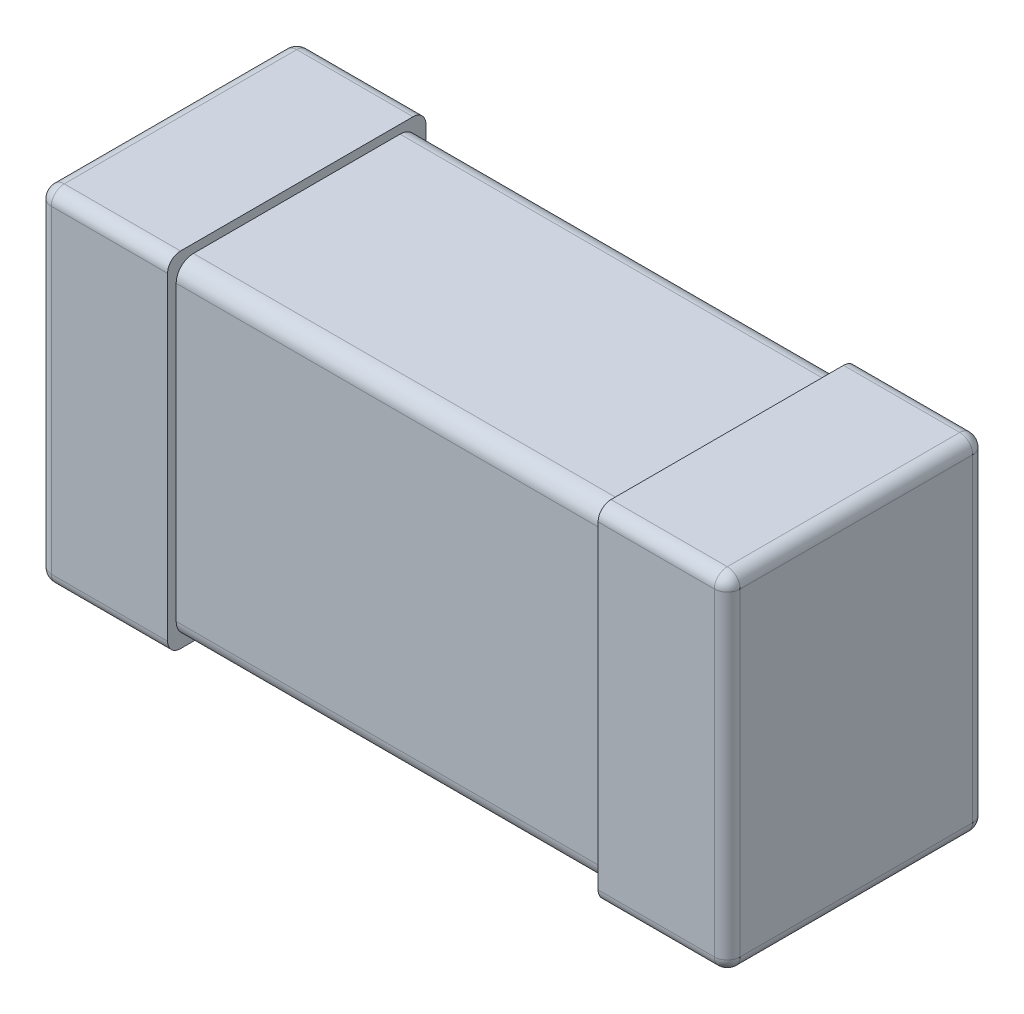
ISO-10303-21;
HEADER;
FILE_DESCRIPTION(('STEP AP214'),'2;1');
FILE_NAME('part.step','',(''),(''),'','','');
FILE_SCHEMA(('AUTOMOTIVE_DESIGN { 1 0 10303 214 1 1 1 1 }'));
ENDSEC;
DATA;
#1=APPLICATION_CONTEXT('core data for automotive mechanical design processes');
#2=APPLICATION_PROTOCOL_DEFINITION('international standard','automotive_design',2000,#1);
#3=PRODUCT_CONTEXT('',#1,'mechanical');
#4=PRODUCT('Part','Part','',(#3));
#5=PRODUCT_RELATED_PRODUCT_CATEGORY('part','',(#4));
#6=PRODUCT_DEFINITION_FORMATION('','',#4);
#7=PRODUCT_DEFINITION_CONTEXT('part definition',#1,'design');
#8=PRODUCT_DEFINITION('design','',#6,#7);
#9=PRODUCT_DEFINITION_SHAPE('','',#8);
#10=(LENGTH_UNIT() NAMED_UNIT(*) SI_UNIT(.MILLI.,.METRE.));
#11=(NAMED_UNIT(*) PLANE_ANGLE_UNIT() SI_UNIT($,.RADIAN.));
#12=(NAMED_UNIT(*) SI_UNIT($,.STERADIAN.) SOLID_ANGLE_UNIT());
#13=UNCERTAINTY_MEASURE_WITH_UNIT(LENGTH_MEASURE(1.E-05),#10,'distance_accuracy_value','');
#14=(GEOMETRIC_REPRESENTATION_CONTEXT(3) GLOBAL_UNCERTAINTY_ASSIGNED_CONTEXT((#13)) GLOBAL_UNIT_ASSIGNED_CONTEXT((#10,
#11,#12)) REPRESENTATION_CONTEXT('',''));
#15=CARTESIAN_POINT('',(0.,0.,0.));
#16=DIRECTION('',(0.,0.,1.));
#17=DIRECTION('',(1.,0.,0.));
#18=AXIS2_PLACEMENT_3D('',#15,#16,#17);
#19=CARTESIAN_POINT('',(0.8,0.4,0.6));
#20=DIRECTION('',(-1.,0.,0.));
#21=DIRECTION('',(0.,0.,1.));
#22=AXIS2_PLACEMENT_3D('',#19,#20,#21);
#23=PLANE('',#22);
#24=DIRECTION('',(0.,0.,-1.));
#25=VECTOR('',#24,1.);
#26=CARTESIAN_POINT('',(0.8,-0.37,0.6));
#27=LINE('',#26,#25);
#28=CARTESIAN_POINT('',(0.8,-0.37,0.03));
#29=VERTEX_POINT('',#28);
#30=CARTESIAN_POINT('',(0.8,-0.37,0.57));
#31=VERTEX_POINT('',#30);
#32=EDGE_CURVE('E514',#29,#31,#27,.F.);
#33=ORIENTED_EDGE('',*,*,#32,.F.);
#34=DIRECTION('',(0.,-1.,0.));
#35=VECTOR('',#34,1.);
#36=CARTESIAN_POINT('',(0.8,0.4,0.03));
#37=LINE('',#36,#35);
#38=CARTESIAN_POINT('',(0.8,0.37,0.03));
#39=VERTEX_POINT('',#38);
#40=EDGE_CURVE('E513',#39,#29,#37,.T.);
#41=ORIENTED_EDGE('',*,*,#40,.F.);
#42=DIRECTION('',(0.,0.,-1.));
#43=VECTOR('',#42,1.);
#44=CARTESIAN_POINT('',(0.8,0.37,0.6));
#45=LINE('',#44,#43);
#46=CARTESIAN_POINT('',(0.8,0.37,0.57));
#47=VERTEX_POINT('',#46);
#48=EDGE_CURVE('E480',#47,#39,#45,.T.);
#49=ORIENTED_EDGE('',*,*,#48,.F.);
#50=DIRECTION('',(0.,1.,0.));
#51=VECTOR('',#50,1.);
#52=CARTESIAN_POINT('',(0.8,-0.4,0.57));
#53=LINE('',#52,#51);
#54=EDGE_CURVE('E583',#31,#47,#53,.T.);
#55=ORIENTED_EDGE('',*,*,#54,.F.);
#56=EDGE_LOOP('',(#33,#41,#49,#55));
#57=FACE_BOUND('',#56,.T.);
#58=ADVANCED_FACE('F17',(#57),#23,.F.);
#59=CARTESIAN_POINT('',(-0.8,0.4,0.6));
#60=DIRECTION('',(1.,0.,0.));
#61=DIRECTION('',(0.,0.,-1.));
#62=AXIS2_PLACEMENT_3D('',#59,#60,#61);
#63=PLANE('',#62);
#64=DIRECTION('',(0.,0.,-1.));
#65=VECTOR('',#64,1.);
#66=CARTESIAN_POINT('',(-0.8,0.37,0.6));
#67=LINE('',#66,#65);
#68=CARTESIAN_POINT('',(-0.8,0.37,0.03));
#69=VERTEX_POINT('',#68);
#70=CARTESIAN_POINT('',(-0.8,0.37,0.57));
#71=VERTEX_POINT('',#70);
#72=EDGE_CURVE('E555',#69,#71,#67,.F.);
#73=ORIENTED_EDGE('',*,*,#72,.F.);
#74=DIRECTION('',(0.,-1.,0.));
#75=VECTOR('',#74,1.);
#76=CARTESIAN_POINT('',(-0.8,0.4,0.03));
#77=LINE('',#76,#75);
#78=CARTESIAN_POINT('',(-0.8,-0.37,0.03));
#79=VERTEX_POINT('',#78);
#80=EDGE_CURVE('E370',#79,#69,#77,.F.);
#81=ORIENTED_EDGE('',*,*,#80,.F.);
#82=DIRECTION('',(0.,0.,-1.));
#83=VECTOR('',#82,1.);
#84=CARTESIAN_POINT('',(-0.8,-0.37,0.6));
#85=LINE('',#84,#83);
#86=CARTESIAN_POINT('',(-0.8,-0.37,0.57));
#87=VERTEX_POINT('',#86);
#88=EDGE_CURVE('E564',#87,#79,#85,.T.);
#89=ORIENTED_EDGE('',*,*,#88,.F.);
#90=DIRECTION('',(0.,1.,0.));
#91=VECTOR('',#90,1.);
#92=CARTESIAN_POINT('',(-0.8,-0.4,0.57));
#93=LINE('',#92,#91);
#94=EDGE_CURVE('E420',#71,#87,#93,.F.);
#95=ORIENTED_EDGE('',*,*,#94,.F.);
#96=EDGE_LOOP('',(#73,#81,#89,#95));
#97=FACE_BOUND('',#96,.T.);
#98=ADVANCED_FACE('F544',(#97),#63,.F.);
#99=CARTESIAN_POINT('',(0.77,0.37,0.57));
#100=DIRECTION('',(1.,0.,0.));
#101=DIRECTION('',(0.,0.,-1.));
#102=AXIS2_PLACEMENT_3D('',#99,#100,#101);
#103=SPHERICAL_SURFACE('',#102,0.03);
#104=CARTESIAN_POINT('',(0.77,0.37,0.57));
#105=DIRECTION('',(-1.,0.,0.));
#106=DIRECTION('',(0.,-1.,0.));
#107=AXIS2_PLACEMENT_3D('',#104,#105,#106);
#108=CIRCLE('',#107,0.03);
#109=CARTESIAN_POINT('',(0.77,0.37,0.6));
#110=VERTEX_POINT('',#109);
#111=CARTESIAN_POINT('',(0.77,0.4,0.57));
#112=VERTEX_POINT('',#111);
#113=EDGE_CURVE('E361',#110,#112,#108,.T.);
#114=ORIENTED_EDGE('',*,*,#113,.F.);
#115=CARTESIAN_POINT('',(0.77,0.37,0.57));
#116=DIRECTION('',(0.,1.,0.));
#117=DIRECTION('',(0.,0.,1.));
#118=AXIS2_PLACEMENT_3D('',#115,#116,#117);
#119=CIRCLE('',#118,0.03);
#120=EDGE_CURVE('E586',#47,#110,#119,.F.);
#121=ORIENTED_EDGE('',*,*,#120,.F.);
#122=CARTESIAN_POINT('',(0.77,0.37,0.57));
#123=DIRECTION('',(0.,0.,-1.));
#124=DIRECTION('',(-1.,0.,0.));
#125=AXIS2_PLACEMENT_3D('',#122,#123,#124);
#126=CIRCLE('',#125,0.03);
#127=EDGE_CURVE('E466',#112,#47,#126,.T.);
#128=ORIENTED_EDGE('',*,*,#127,.F.);
#129=EDGE_LOOP('',(#114,#121,#128));
#130=FACE_BOUND('',#129,.T.);
#131=ADVANCED_FACE('F540',(#130),#103,.T.);
#132=CARTESIAN_POINT('',(0.77,-0.4,0.57));
#133=DIRECTION('',(0.,1.,0.));
#134=DIRECTION('',(0.,0.,1.));
#135=AXIS2_PLACEMENT_3D('',#132,#133,#134);
#136=CYLINDRICAL_SURFACE('',#135,0.03);
#137=CARTESIAN_POINT('',(0.77,-0.37,0.57));
#138=DIRECTION('',(0.,-1.,0.));
#139=DIRECTION('',(1.,0.,0.));
#140=AXIS2_PLACEMENT_3D('',#137,#138,#139);
#141=CIRCLE('',#140,0.03);
#142=CARTESIAN_POINT('',(0.77,-0.37,0.6));
#143=VERTEX_POINT('',#142);
#144=EDGE_CURVE('E520',#31,#143,#141,.T.);
#145=ORIENTED_EDGE('',*,*,#144,.F.);
#146=ORIENTED_EDGE('',*,*,#54,.T.);
#147=ORIENTED_EDGE('',*,*,#120,.T.);
#148=DIRECTION('',(0.,1.,0.));
#149=VECTOR('',#148,1.);
#150=CARTESIAN_POINT('',(0.77,-0.4,0.6));
#151=LINE('',#150,#149);
#152=EDGE_CURVE('E360',#110,#143,#151,.F.);
#153=ORIENTED_EDGE('',*,*,#152,.T.);
#154=EDGE_LOOP('',(#145,#146,#147,#153));
#155=FACE_BOUND('',#154,.T.);
#156=ADVANCED_FACE('F536',(#155),#136,.T.);
#157=CARTESIAN_POINT('',(0.77,-0.37,0.57));
#158=DIRECTION('',(1.,0.,0.));
#159=DIRECTION('',(0.,0.,-1.));
#160=AXIS2_PLACEMENT_3D('',#157,#158,#159);
#161=SPHERICAL_SURFACE('',#160,0.03);
#162=CARTESIAN_POINT('',(0.77,-0.37,0.57));
#163=DIRECTION('',(1.,0.,0.));
#164=DIRECTION('',(0.,1.,0.));
#165=AXIS2_PLACEMENT_3D('',#162,#163,#164);
#166=CIRCLE('',#165,0.03);
#167=CARTESIAN_POINT('',(0.77,-0.4,0.57));
#168=VERTEX_POINT('',#167);
#169=EDGE_CURVE('E354',#168,#143,#166,.F.);
#170=ORIENTED_EDGE('',*,*,#169,.F.);
#171=CARTESIAN_POINT('',(0.77,-0.37,0.57));
#172=DIRECTION('',(0.,0.,-1.));
#173=DIRECTION('',(-1.,0.,0.));
#174=AXIS2_PLACEMENT_3D('',#171,#172,#173);
#175=CIRCLE('',#174,0.03);
#176=EDGE_CURVE('E517',#31,#168,#175,.T.);
#177=ORIENTED_EDGE('',*,*,#176,.F.);
#178=ORIENTED_EDGE('',*,*,#144,.T.);
#179=EDGE_LOOP('',(#170,#177,#178));
#180=FACE_BOUND('',#179,.T.);
#181=ADVANCED_FACE('F533',(#180),#161,.T.);
#182=CARTESIAN_POINT('',(0.77,-0.37,0.6));
#183=DIRECTION('',(0.,0.,-1.));
#184=DIRECTION('',(-1.,0.,0.));
#185=AXIS2_PLACEMENT_3D('',#182,#183,#184);
#186=CYLINDRICAL_SURFACE('',#185,0.03);
#187=CARTESIAN_POINT('',(0.77,-0.37,0.03));
#188=DIRECTION('',(0.,-2.6663722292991E-13,-1.));
#189=DIRECTION('',(1.,0.,0.));
#190=AXIS2_PLACEMENT_3D('',#187,#188,#189);
#191=CIRCLE('',#190,0.03);
#192=CARTESIAN_POINT('',(0.77,-0.4,0.030000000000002));
#193=VERTEX_POINT('',#192);
#194=EDGE_CURVE('E510',#29,#193,#191,.T.);
#195=ORIENTED_EDGE('',*,*,#194,.F.);
#196=ORIENTED_EDGE('',*,*,#32,.T.);
#197=ORIENTED_EDGE('',*,*,#176,.T.);
#198=DIRECTION('',(0.,0.,1.));
#199=VECTOR('',#198,1.);
#200=CARTESIAN_POINT('',(0.77,-0.4,0.6));
#201=LINE('',#200,#199);
#202=EDGE_CURVE('E348',#168,#193,#201,.F.);
#203=ORIENTED_EDGE('',*,*,#202,.T.);
#204=EDGE_LOOP('',(#195,#196,#197,#203));
#205=FACE_BOUND('',#204,.T.);
#206=ADVANCED_FACE('F502',(#205),#186,.T.);
#207=CARTESIAN_POINT('',(0.77,-0.37,0.03));
#208=DIRECTION('',(1.,0.,0.));
#209=DIRECTION('',(0.,0.,-1.));
#210=AXIS2_PLACEMENT_3D('',#207,#208,#209);
#211=SPHERICAL_SURFACE('',#210,0.03);
#212=CARTESIAN_POINT('',(0.77,-0.37,0.03));
#213=DIRECTION('',(0.,-1.,0.));
#214=DIRECTION('',(0.,0.,-1.));
#215=AXIS2_PLACEMENT_3D('',#212,#213,#214);
#216=CIRCLE('',#215,0.03);
#217=CARTESIAN_POINT('',(0.77,-0.37,0.));
#218=VERTEX_POINT('',#217);
#219=EDGE_CURVE('E576',#29,#218,#216,.F.);
#220=ORIENTED_EDGE('',*,*,#219,.F.);
#221=ORIENTED_EDGE('',*,*,#194,.T.);
#222=CARTESIAN_POINT('',(0.77,-0.37,0.03));
#223=DIRECTION('',(-1.,0.,0.));
#224=DIRECTION('',(0.,-1.,0.));
#225=AXIS2_PLACEMENT_3D('',#222,#223,#224);
#226=CIRCLE('',#225,0.03);
#227=EDGE_CURVE('E342',#218,#193,#226,.T.);
#228=ORIENTED_EDGE('',*,*,#227,.F.);
#229=EDGE_LOOP('',(#220,#221,#228));
#230=FACE_BOUND('',#229,.T.);
#231=ADVANCED_FACE('F497',(#230),#211,.T.);
#232=CARTESIAN_POINT('',(0.77,0.4,0.03));
#233=DIRECTION('',(0.,-1.,0.));
#234=DIRECTION('',(0.,0.,-1.));
#235=AXIS2_PLACEMENT_3D('',#232,#233,#234);
#236=CYLINDRICAL_SURFACE('',#235,0.03);
#237=ORIENTED_EDGE('',*,*,#219,.T.);
#238=DIRECTION('',(0.,1.,0.));
#239=VECTOR('',#238,1.);
#240=CARTESIAN_POINT('',(0.77,-0.4,0.));
#241=LINE('',#240,#239);
#242=CARTESIAN_POINT('',(0.77,0.37,0.));
#243=VERTEX_POINT('',#242);
#244=EDGE_CURVE('E336',#243,#218,#241,.F.);
#245=ORIENTED_EDGE('',*,*,#244,.F.);
#246=CARTESIAN_POINT('',(0.77,0.37,0.03));
#247=DIRECTION('',(0.,1.,0.));
#248=DIRECTION('',(1.,0.,0.));
#249=AXIS2_PLACEMENT_3D('',#246,#247,#248);
#250=CIRCLE('',#249,0.03);
#251=EDGE_CURVE('E467',#39,#243,#250,.T.);
#252=ORIENTED_EDGE('',*,*,#251,.F.);
#253=ORIENTED_EDGE('',*,*,#40,.T.);
#254=EDGE_LOOP('',(#237,#245,#252,#253));
#255=FACE_BOUND('',#254,.T.);
#256=ADVANCED_FACE('F493',(#255),#236,.T.);
#257=CARTESIAN_POINT('',(0.77,0.37,0.03));
#258=DIRECTION('',(1.,0.,0.));
#259=DIRECTION('',(0.,0.,-1.));
#260=AXIS2_PLACEMENT_3D('',#257,#258,#259);
#261=SPHERICAL_SURFACE('',#260,0.03);
#262=CARTESIAN_POINT('',(0.77,0.37,0.03));
#263=DIRECTION('',(0.,0.,-1.));
#264=DIRECTION('',(-1.,0.,0.));
#265=AXIS2_PLACEMENT_3D('',#262,#263,#264);
#266=CIRCLE('',#265,0.03);
#267=CARTESIAN_POINT('',(0.77,0.4,0.03));
#268=VERTEX_POINT('',#267);
#269=EDGE_CURVE('E463',#39,#268,#266,.F.);
#270=ORIENTED_EDGE('',*,*,#269,.F.);
#271=ORIENTED_EDGE('',*,*,#251,.T.);
#272=CARTESIAN_POINT('',(0.77,0.37,0.03));
#273=DIRECTION('',(1.,0.,0.));
#274=DIRECTION('',(0.,1.,0.));
#275=AXIS2_PLACEMENT_3D('',#272,#273,#274);
#276=CIRCLE('',#275,0.03);
#277=EDGE_CURVE('E330',#268,#243,#276,.F.);
#278=ORIENTED_EDGE('',*,*,#277,.F.);
#279=EDGE_LOOP('',(#270,#271,#278));
#280=FACE_BOUND('',#279,.T.);
#281=ADVANCED_FACE('F490',(#280),#261,.T.);
#282=CARTESIAN_POINT('',(0.77,0.37,0.6));
#283=DIRECTION('',(0.,0.,-1.));
#284=DIRECTION('',(-1.,0.,0.));
#285=AXIS2_PLACEMENT_3D('',#282,#283,#284);
#286=CYLINDRICAL_SURFACE('',#285,0.03);
#287=ORIENTED_EDGE('',*,*,#127,.T.);
#288=ORIENTED_EDGE('',*,*,#48,.T.);
#289=ORIENTED_EDGE('',*,*,#269,.T.);
#290=DIRECTION('',(0.,0.,1.));
#291=VECTOR('',#290,1.);
#292=CARTESIAN_POINT('',(0.77,0.4,0.6));
#293=LINE('',#292,#291);
#294=EDGE_CURVE('E316',#268,#112,#293,.T.);
#295=ORIENTED_EDGE('',*,*,#294,.T.);
#296=EDGE_LOOP('',(#287,#288,#289,#295));
#297=FACE_BOUND('',#296,.T.);
#298=ADVANCED_FACE('F451',(#297),#286,.T.);
#299=CARTESIAN_POINT('',(-0.77,-0.37,0.03));
#300=DIRECTION('',(1.,0.,0.));
#301=DIRECTION('',(0.,0.,-1.));
#302=AXIS2_PLACEMENT_3D('',#299,#300,#301);
#303=SPHERICAL_SURFACE('',#302,0.03);
#304=CARTESIAN_POINT('',(-0.77,-0.37,0.03));
#305=DIRECTION('',(0.,0.,-1.));
#306=DIRECTION('',(-1.,0.,0.));
#307=AXIS2_PLACEMENT_3D('',#304,#305,#306);
#308=CIRCLE('',#307,0.03);
#309=CARTESIAN_POINT('',(-0.77,-0.4,0.03));
#310=VERTEX_POINT('',#309);
#311=EDGE_CURVE('E567',#79,#310,#308,.F.);
#312=ORIENTED_EDGE('',*,*,#311,.F.);
#313=CARTESIAN_POINT('',(-0.77,-0.37,0.03));
#314=DIRECTION('',(0.,-1.,0.));
#315=DIRECTION('',(0.,0.,-1.));
#316=AXIS2_PLACEMENT_3D('',#313,#314,#315);
#317=CIRCLE('',#316,0.03);
#318=CARTESIAN_POINT('',(-0.77,-0.37,0.));
#319=VERTEX_POINT('',#318);
#320=EDGE_CURVE('E381',#319,#79,#317,.F.);
#321=ORIENTED_EDGE('',*,*,#320,.F.);
#322=CARTESIAN_POINT('',(-0.77,-0.37,0.03));
#323=DIRECTION('',(1.,0.,0.));
#324=DIRECTION('',(0.,0.,-1.));
#325=AXIS2_PLACEMENT_3D('',#322,#323,#324);
#326=CIRCLE('',#325,0.03);
#327=EDGE_CURVE('E303',#310,#319,#326,.T.);
#328=ORIENTED_EDGE('',*,*,#327,.F.);
#329=EDGE_LOOP('',(#312,#321,#328));
#330=FACE_BOUND('',#329,.T.);
#331=ADVANCED_FACE('F446',(#330),#303,.T.);
#332=CARTESIAN_POINT('',(-0.77,-0.37,0.6));
#333=DIRECTION('',(0.,0.,-1.));
#334=DIRECTION('',(-1.,0.,0.));
#335=AXIS2_PLACEMENT_3D('',#332,#333,#334);
#336=CYLINDRICAL_SURFACE('',#335,0.03);
#337=CARTESIAN_POINT('',(-0.77,-0.37,0.57));
#338=DIRECTION('',(0.,-8.51781474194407E-12,-1.));
#339=DIRECTION('',(1.,0.,0.));
#340=AXIS2_PLACEMENT_3D('',#337,#338,#339);
#341=CIRCLE('',#340,0.03);
#342=CARTESIAN_POINT('',(-0.77,-0.4,0.570000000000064));
#343=VERTEX_POINT('',#342);
#344=EDGE_CURVE('E430',#87,#343,#341,.F.);
#345=ORIENTED_EDGE('',*,*,#344,.F.);
#346=ORIENTED_EDGE('',*,*,#88,.T.);
#347=ORIENTED_EDGE('',*,*,#311,.T.);
#348=DIRECTION('',(0.,0.,1.));
#349=VECTOR('',#348,1.);
#350=CARTESIAN_POINT('',(-0.77,-0.4,0.6));
#351=LINE('',#350,#349);
#352=EDGE_CURVE('E302',#310,#343,#351,.T.);
#353=ORIENTED_EDGE('',*,*,#352,.T.);
#354=EDGE_LOOP('',(#345,#346,#347,#353));
#355=FACE_BOUND('',#354,.T.);
#356=ADVANCED_FACE('F442',(#355),#336,.T.);
#357=CARTESIAN_POINT('',(-0.77,-0.37,0.57));
#358=DIRECTION('',(1.,0.,0.));
#359=DIRECTION('',(0.,0.,-1.));
#360=AXIS2_PLACEMENT_3D('',#357,#358,#359);
#361=SPHERICAL_SURFACE('',#360,0.03);
#362=CARTESIAN_POINT('',(-0.77,-0.37,0.57));
#363=DIRECTION('',(-1.,0.,0.));
#364=DIRECTION('',(0.,0.,1.));
#365=AXIS2_PLACEMENT_3D('',#362,#363,#364);
#366=CIRCLE('',#365,0.03);
#367=CARTESIAN_POINT('',(-0.77,-0.37,0.6));
#368=VERTEX_POINT('',#367);
#369=EDGE_CURVE('E296',#368,#343,#366,.F.);
#370=ORIENTED_EDGE('',*,*,#369,.F.);
#371=CARTESIAN_POINT('',(-0.77,-0.37,0.57));
#372=DIRECTION('',(0.,1.,0.));
#373=DIRECTION('',(0.,0.,1.));
#374=AXIS2_PLACEMENT_3D('',#371,#372,#373);
#375=CIRCLE('',#374,0.03);
#376=EDGE_CURVE('E427',#87,#368,#375,.T.);
#377=ORIENTED_EDGE('',*,*,#376,.F.);
#378=ORIENTED_EDGE('',*,*,#344,.T.);
#379=EDGE_LOOP('',(#370,#377,#378));
#380=FACE_BOUND('',#379,.T.);
#381=ADVANCED_FACE('F439',(#380),#361,.T.);
#382=CARTESIAN_POINT('',(-0.77,-0.4,0.57));
#383=DIRECTION('',(0.,1.,0.));
#384=DIRECTION('',(0.,0.,1.));
#385=AXIS2_PLACEMENT_3D('',#382,#383,#384);
#386=CYLINDRICAL_SURFACE('',#385,0.03);
#387=CARTESIAN_POINT('',(-0.77,0.37,0.57));
#388=DIRECTION('',(0.,-1.,0.));
#389=DIRECTION('',(1.,0.,0.));
#390=AXIS2_PLACEMENT_3D('',#387,#388,#389);
#391=CIRCLE('',#390,0.03);
#392=CARTESIAN_POINT('',(-0.77,0.37,0.6));
#393=VERTEX_POINT('',#392);
#394=EDGE_CURVE('E416',#71,#393,#391,.F.);
#395=ORIENTED_EDGE('',*,*,#394,.F.);
#396=ORIENTED_EDGE('',*,*,#94,.T.);
#397=ORIENTED_EDGE('',*,*,#376,.T.);
#398=DIRECTION('',(0.,1.,0.));
#399=VECTOR('',#398,1.);
#400=CARTESIAN_POINT('',(-0.77,-0.4,0.6));
#401=LINE('',#400,#399);
#402=EDGE_CURVE('E290',#393,#368,#401,.F.);
#403=ORIENTED_EDGE('',*,*,#402,.F.);
#404=EDGE_LOOP('',(#395,#396,#397,#403));
#405=FACE_BOUND('',#404,.T.);
#406=ADVANCED_FACE('F408',(#405),#386,.T.);
#407=CARTESIAN_POINT('',(-0.77,0.37,0.57));
#408=DIRECTION('',(1.,0.,0.));
#409=DIRECTION('',(0.,0.,-1.));
#410=AXIS2_PLACEMENT_3D('',#407,#408,#409);
#411=SPHERICAL_SURFACE('',#410,0.03);
#412=CARTESIAN_POINT('',(-0.77,0.37,0.57));
#413=DIRECTION('',(1.,0.,0.));
#414=DIRECTION('',(0.,0.,-1.));
#415=AXIS2_PLACEMENT_3D('',#412,#413,#414);
#416=CIRCLE('',#415,0.03);
#417=CARTESIAN_POINT('',(-0.77,0.4,0.57));
#418=VERTEX_POINT('',#417);
#419=EDGE_CURVE('E284',#418,#393,#416,.T.);
#420=ORIENTED_EDGE('',*,*,#419,.F.);
#421=CARTESIAN_POINT('',(-0.77,0.37,0.57));
#422=DIRECTION('',(0.,0.,-1.));
#423=DIRECTION('',(-1.,0.,0.));
#424=AXIS2_PLACEMENT_3D('',#421,#422,#423);
#425=CIRCLE('',#424,0.03);
#426=EDGE_CURVE('E419',#71,#418,#425,.T.);
#427=ORIENTED_EDGE('',*,*,#426,.F.);
#428=ORIENTED_EDGE('',*,*,#394,.T.);
#429=EDGE_LOOP('',(#420,#427,#428));
#430=FACE_BOUND('',#429,.T.);
#431=ADVANCED_FACE('F403',(#430),#411,.T.);
#432=CARTESIAN_POINT('',(-0.77,0.37,0.6));
#433=DIRECTION('',(0.,0.,-1.));
#434=DIRECTION('',(-1.,0.,0.));
#435=AXIS2_PLACEMENT_3D('',#432,#433,#434);
#436=CYLINDRICAL_SURFACE('',#435,0.03);
#437=CARTESIAN_POINT('',(-0.77,0.37,0.03));
#438=DIRECTION('',(0.,0.,1.));
#439=DIRECTION('',(1.,0.,0.));
#440=AXIS2_PLACEMENT_3D('',#437,#438,#439);
#441=CIRCLE('',#440,0.03);
#442=CARTESIAN_POINT('',(-0.77,0.4,0.03));
#443=VERTEX_POINT('',#442);
#444=EDGE_CURVE('E384',#69,#443,#441,.F.);
#445=ORIENTED_EDGE('',*,*,#444,.F.);
#446=ORIENTED_EDGE('',*,*,#72,.T.);
#447=ORIENTED_EDGE('',*,*,#426,.T.);
#448=DIRECTION('',(0.,0.,-1.));
#449=VECTOR('',#448,1.);
#450=CARTESIAN_POINT('',(-0.77,0.4,0.6));
#451=LINE('',#450,#449);
#452=EDGE_CURVE('E278',#418,#443,#451,.T.);
#453=ORIENTED_EDGE('',*,*,#452,.T.);
#454=EDGE_LOOP('',(#445,#446,#447,#453));
#455=FACE_BOUND('',#454,.T.);
#456=ADVANCED_FACE('F399',(#455),#436,.T.);
#457=CARTESIAN_POINT('',(-0.77,0.37,0.03));
#458=DIRECTION('',(1.,0.,0.));
#459=DIRECTION('',(0.,0.,-1.));
#460=AXIS2_PLACEMENT_3D('',#457,#458,#459);
#461=SPHERICAL_SURFACE('',#460,0.03);
#462=CARTESIAN_POINT('',(-0.77,0.37,0.03));
#463=DIRECTION('',(0.,-1.,0.));
#464=DIRECTION('',(0.,0.,-1.));
#465=AXIS2_PLACEMENT_3D('',#462,#463,#464);
#466=CIRCLE('',#465,0.03);
#467=CARTESIAN_POINT('',(-0.77,0.37,0.));
#468=VERTEX_POINT('',#467);
#469=EDGE_CURVE('E367',#69,#468,#466,.T.);
#470=ORIENTED_EDGE('',*,*,#469,.F.);
#471=ORIENTED_EDGE('',*,*,#444,.T.);
#472=CARTESIAN_POINT('',(-0.77,0.37,0.03));
#473=DIRECTION('',(-1.,0.,0.));
#474=DIRECTION('',(0.,0.,1.));
#475=AXIS2_PLACEMENT_3D('',#472,#473,#474);
#476=CIRCLE('',#475,0.03);
#477=EDGE_CURVE('E136',#468,#443,#476,.F.);
#478=ORIENTED_EDGE('',*,*,#477,.F.);
#479=EDGE_LOOP('',(#470,#471,#478));
#480=FACE_BOUND('',#479,.T.);
#481=ADVANCED_FACE('F394',(#480),#461,.T.);
#482=CARTESIAN_POINT('',(-0.77,0.4,0.03));
#483=DIRECTION('',(0.,-1.,0.));
#484=DIRECTION('',(0.,0.,-1.));
#485=AXIS2_PLACEMENT_3D('',#482,#483,#484);
#486=CYLINDRICAL_SURFACE('',#485,0.03);
#487=ORIENTED_EDGE('',*,*,#469,.T.);
#488=DIRECTION('',(0.,1.,0.));
#489=VECTOR('',#488,1.);
#490=CARTESIAN_POINT('',(-0.77,-0.4,0.));
#491=LINE('',#490,#489);
#492=EDGE_CURVE('E263',#468,#319,#491,.F.);
#493=ORIENTED_EDGE('',*,*,#492,.T.);
#494=ORIENTED_EDGE('',*,*,#320,.T.);
#495=ORIENTED_EDGE('',*,*,#80,.T.);
#496=EDGE_LOOP('',(#487,#493,#494,#495));
#497=FACE_BOUND('',#496,.T.);
#498=ADVANCED_FACE('F398',(#497),#486,.T.);
#499=CARTESIAN_POINT('',(0.5,0.37,0.57));
#500=DIRECTION('',(-1.,0.,0.));
#501=DIRECTION('',(0.,-1.,0.));
#502=AXIS2_PLACEMENT_3D('',#499,#500,#501);
#503=CYLINDRICAL_SURFACE('',#502,0.03);
#504=ORIENTED_EDGE('',*,*,#113,.T.);
#505=DIRECTION('',(1.,0.,0.));
#506=VECTOR('',#505,1.);
#507=CARTESIAN_POINT('',(0.8,0.4,0.57));
#508=LINE('',#507,#506);
#509=CARTESIAN_POINT('',(0.5,0.4,0.57));
#510=VERTEX_POINT('',#509);
#511=EDGE_CURVE('E321',#112,#510,#508,.F.);
#512=ORIENTED_EDGE('',*,*,#511,.T.);
#513=CARTESIAN_POINT('',(0.5,0.37,0.57));
#514=DIRECTION('',(-1.,0.,0.));
#515=DIRECTION('',(0.,-1.,0.));
#516=AXIS2_PLACEMENT_3D('',#513,#514,#515);
#517=CIRCLE('',#516,0.03);
#518=CARTESIAN_POINT('',(0.5,0.37,0.6));
#519=VERTEX_POINT('',#518);
#520=EDGE_CURVE('E251',#510,#519,#517,.F.);
#521=ORIENTED_EDGE('',*,*,#520,.T.);
#522=DIRECTION('',(-1.,0.,0.));
#523=VECTOR('',#522,1.);
#524=CARTESIAN_POINT('',(0.5,0.37,0.6));
#525=LINE('',#524,#523);
#526=EDGE_CURVE('E357',#519,#110,#525,.F.);
#527=ORIENTED_EDGE('',*,*,#526,.T.);
#528=EDGE_LOOP('',(#504,#512,#521,#527));
#529=FACE_BOUND('',#528,.T.);
#530=ADVANCED_FACE('F938',(#529),#503,.T.);
#531=CARTESIAN_POINT('',(0.5,-0.4,0.6));
#532=DIRECTION('',(0.,0.,-1.));
#533=DIRECTION('',(-1.,0.,0.));
#534=AXIS2_PLACEMENT_3D('',#531,#532,#533);
#535=PLANE('',#534);
#536=ORIENTED_EDGE('',*,*,#526,.F.);
#537=DIRECTION('',(0.,1.,0.));
#538=VECTOR('',#537,1.);
#539=CARTESIAN_POINT('',(0.5,0.4,0.6));
#540=LINE('',#539,#538);
#541=CARTESIAN_POINT('',(0.5,-0.37,0.6));
#542=VERTEX_POINT('',#541);
#543=EDGE_CURVE('E249',#519,#542,#540,.F.);
#544=ORIENTED_EDGE('',*,*,#543,.T.);
#545=DIRECTION('',(1.,0.,0.));
#546=VECTOR('',#545,1.);
#547=CARTESIAN_POINT('',(0.5,-0.37,0.6));
#548=LINE('',#547,#546);
#549=EDGE_CURVE('E349',#143,#542,#548,.F.);
#550=ORIENTED_EDGE('',*,*,#549,.F.);
#551=ORIENTED_EDGE('',*,*,#152,.F.);
#552=EDGE_LOOP('',(#536,#544,#550,#551));
#553=FACE_BOUND('',#552,.T.);
#554=ADVANCED_FACE('F928',(#553),#535,.F.);
#555=CARTESIAN_POINT('',(0.5,-0.37,0.57));
#556=DIRECTION('',(1.,0.,0.));
#557=DIRECTION('',(0.,1.,0.));
#558=AXIS2_PLACEMENT_3D('',#555,#556,#557);
#559=CYLINDRICAL_SURFACE('',#558,0.03);
#560=ORIENTED_EDGE('',*,*,#169,.T.);
#561=ORIENTED_EDGE('',*,*,#549,.T.);
#562=CARTESIAN_POINT('',(0.5,-0.37,0.57));
#563=DIRECTION('',(1.,0.,0.));
#564=DIRECTION('',(0.,1.,0.));
#565=AXIS2_PLACEMENT_3D('',#562,#563,#564);
#566=CIRCLE('',#565,0.03);
#567=CARTESIAN_POINT('',(0.5,-0.4,0.57));
#568=VERTEX_POINT('',#567);
#569=EDGE_CURVE('E248',#542,#568,#566,.T.);
#570=ORIENTED_EDGE('',*,*,#569,.T.);
#571=DIRECTION('',(-1.,0.,0.));
#572=VECTOR('',#571,1.);
#573=CARTESIAN_POINT('',(0.8,-0.4,0.57));
#574=LINE('',#573,#572);
#575=EDGE_CURVE('E345',#568,#168,#574,.F.);
#576=ORIENTED_EDGE('',*,*,#575,.T.);
#577=EDGE_LOOP('',(#560,#561,#570,#576));
#578=FACE_BOUND('',#577,.T.);
#579=ADVANCED_FACE('F918',(#578),#559,.T.);
#580=CARTESIAN_POINT('',(0.8,-0.4,0.6));
#581=DIRECTION('',(0.,1.,0.));
#582=DIRECTION('',(-1.,0.,0.));
#583=AXIS2_PLACEMENT_3D('',#580,#581,#582);
#584=PLANE('',#583);
#585=DIRECTION('',(-1.,0.,0.));
#586=VECTOR('',#585,1.);
#587=CARTESIAN_POINT('',(0.8,-0.4,0.03));
#588=LINE('',#587,#586);
#589=CARTESIAN_POINT('',(0.5,-0.4,0.03));
#590=VERTEX_POINT('',#589);
#591=EDGE_CURVE('E339',#193,#590,#588,.T.);
#592=ORIENTED_EDGE('',*,*,#591,.F.);
#593=ORIENTED_EDGE('',*,*,#202,.F.);
#594=ORIENTED_EDGE('',*,*,#575,.F.);
#595=DIRECTION('',(0.,0.,1.));
#596=VECTOR('',#595,1.);
#597=CARTESIAN_POINT('',(0.5,-0.4,0.6));
#598=LINE('',#597,#596);
#599=EDGE_CURVE('E246',#568,#590,#598,.F.);
#600=ORIENTED_EDGE('',*,*,#599,.T.);
#601=EDGE_LOOP('',(#592,#593,#594,#600));
#602=FACE_BOUND('',#601,.T.);
#603=ADVANCED_FACE('F908',(#602),#584,.F.);
#604=CARTESIAN_POINT('',(0.8,-0.37,0.03));
#605=DIRECTION('',(-1.,0.,0.));
#606=DIRECTION('',(0.,-1.,0.));
#607=AXIS2_PLACEMENT_3D('',#604,#605,#606);
#608=CYLINDRICAL_SURFACE('',#607,0.03);
#609=ORIENTED_EDGE('',*,*,#227,.T.);
#610=ORIENTED_EDGE('',*,*,#591,.T.);
#611=CARTESIAN_POINT('',(0.5,-0.37,0.03));
#612=DIRECTION('',(-1.,0.,0.));
#613=DIRECTION('',(0.,-1.,0.));
#614=AXIS2_PLACEMENT_3D('',#611,#612,#613);
#615=CIRCLE('',#614,0.03);
#616=CARTESIAN_POINT('',(0.5,-0.37,0.));
#617=VERTEX_POINT('',#616);
#618=EDGE_CURVE('E245',#590,#617,#615,.F.);
#619=ORIENTED_EDGE('',*,*,#618,.T.);
#620=DIRECTION('',(-1.,0.,0.));
#621=VECTOR('',#620,1.);
#622=CARTESIAN_POINT('',(0.5,-0.37,0.));
#623=LINE('',#622,#621);
#624=EDGE_CURVE('E333',#218,#617,#623,.T.);
#625=ORIENTED_EDGE('',*,*,#624,.F.);
#626=EDGE_LOOP('',(#609,#610,#619,#625));
#627=FACE_BOUND('',#626,.T.);
#628=ADVANCED_FACE('F898',(#627),#608,.T.);
#629=CARTESIAN_POINT('',(0.5,-0.4,0.));
#630=DIRECTION('',(0.,0.,-1.));
#631=DIRECTION('',(-1.,0.,0.));
#632=AXIS2_PLACEMENT_3D('',#629,#630,#631);
#633=PLANE('',#632);
#634=ORIENTED_EDGE('',*,*,#244,.T.);
#635=ORIENTED_EDGE('',*,*,#624,.T.);
#636=DIRECTION('',(0.,1.,0.));
#637=VECTOR('',#636,1.);
#638=CARTESIAN_POINT('',(0.5,0.4,0.));
#639=LINE('',#638,#637);
#640=CARTESIAN_POINT('',(0.5,0.37,0.));
#641=VERTEX_POINT('',#640);
#642=EDGE_CURVE('E243',#617,#641,#639,.T.);
#643=ORIENTED_EDGE('',*,*,#642,.T.);
#644=DIRECTION('',(1.,0.,0.));
#645=VECTOR('',#644,1.);
#646=CARTESIAN_POINT('',(0.8,0.37,0.));
#647=LINE('',#646,#645);
#648=EDGE_CURVE('E325',#243,#641,#647,.F.);
#649=ORIENTED_EDGE('',*,*,#648,.F.);
#650=EDGE_LOOP('',(#634,#635,#643,#649));
#651=FACE_BOUND('',#650,.T.);
#652=ADVANCED_FACE('F888',(#651),#633,.T.);
#653=CARTESIAN_POINT('',(0.8,0.37,0.03));
#654=DIRECTION('',(1.,0.,0.));
#655=DIRECTION('',(0.,1.,0.));
#656=AXIS2_PLACEMENT_3D('',#653,#654,#655);
#657=CYLINDRICAL_SURFACE('',#656,0.03);
#658=ORIENTED_EDGE('',*,*,#277,.T.);
#659=ORIENTED_EDGE('',*,*,#648,.T.);
#660=CARTESIAN_POINT('',(0.5,0.37,0.03));
#661=DIRECTION('',(1.,0.,0.));
#662=DIRECTION('',(0.,1.,0.));
#663=AXIS2_PLACEMENT_3D('',#660,#661,#662);
#664=CIRCLE('',#663,0.03);
#665=CARTESIAN_POINT('',(0.5,0.4,0.03));
#666=VERTEX_POINT('',#665);
#667=EDGE_CURVE('E242',#641,#666,#664,.T.);
#668=ORIENTED_EDGE('',*,*,#667,.T.);
#669=DIRECTION('',(1.,0.,0.));
#670=VECTOR('',#669,1.);
#671=CARTESIAN_POINT('',(0.8,0.4,0.03));
#672=LINE('',#671,#670);
#673=EDGE_CURVE('E318',#666,#268,#672,.T.);
#674=ORIENTED_EDGE('',*,*,#673,.T.);
#675=EDGE_LOOP('',(#658,#659,#668,#674));
#676=FACE_BOUND('',#675,.T.);
#677=ADVANCED_FACE('F878',(#676),#657,.T.);
#678=CARTESIAN_POINT('',(0.8,0.4,0.6));
#679=DIRECTION('',(0.,-1.,0.));
#680=DIRECTION('',(1.,0.,0.));
#681=AXIS2_PLACEMENT_3D('',#678,#679,#680);
#682=PLANE('',#681);
#683=ORIENTED_EDGE('',*,*,#673,.F.);
#684=DIRECTION('',(0.,0.,1.));
#685=VECTOR('',#684,1.);
#686=CARTESIAN_POINT('',(0.5,0.4,0.6));
#687=LINE('',#686,#685);
#688=EDGE_CURVE('E239',#666,#510,#687,.T.);
#689=ORIENTED_EDGE('',*,*,#688,.T.);
#690=ORIENTED_EDGE('',*,*,#511,.F.);
#691=ORIENTED_EDGE('',*,*,#294,.F.);
#692=EDGE_LOOP('',(#683,#689,#690,#691));
#693=FACE_BOUND('',#692,.T.);
#694=ADVANCED_FACE('F869',(#693),#682,.F.);
#695=CARTESIAN_POINT('',(-0.5,-0.34,0.06));
#696=DIRECTION('',(1.,0.,0.));
#697=DIRECTION('',(0.,0.,-1.));
#698=AXIS2_PLACEMENT_3D('',#695,#696,#697);
#699=CYLINDRICAL_SURFACE('',#698,0.04);
#700=CARTESIAN_POINT('',(0.5,-0.34,0.06));
#701=DIRECTION('',(1.,0.,0.));
#702=DIRECTION('',(0.,0.,-1.));
#703=AXIS2_PLACEMENT_3D('',#700,#701,#702);
#704=CIRCLE('',#703,0.04);
#705=CARTESIAN_POINT('',(0.5,-0.34,0.02));
#706=VERTEX_POINT('',#705);
#707=CARTESIAN_POINT('',(0.5,-0.38,0.06));
#708=VERTEX_POINT('',#707);
#709=EDGE_CURVE('E253',#706,#708,#704,.F.);
#710=ORIENTED_EDGE('',*,*,#709,.T.);
#711=DIRECTION('',(1.,0.,0.));
#712=VECTOR('',#711,1.);
#713=CARTESIAN_POINT('',(-0.5,-0.38,0.06));
#714=LINE('',#713,#712);
#715=CARTESIAN_POINT('',(-0.5,-0.38,0.06));
#716=VERTEX_POINT('',#715);
#717=EDGE_CURVE('E259',#708,#716,#714,.F.);
#718=ORIENTED_EDGE('',*,*,#717,.T.);
#719=CARTESIAN_POINT('',(-0.5,-0.34,0.06));
#720=DIRECTION('',(1.,0.,0.));
#721=DIRECTION('',(0.,0.,-1.));
#722=AXIS2_PLACEMENT_3D('',#719,#720,#721);
#723=CIRCLE('',#722,0.04);
#724=CARTESIAN_POINT('',(-0.5,-0.34,0.02));
#725=VERTEX_POINT('',#724);
#726=EDGE_CURVE('E608',#716,#725,#723,.T.);
#727=ORIENTED_EDGE('',*,*,#726,.T.);
#728=DIRECTION('',(1.,0.,0.));
#729=VECTOR('',#728,1.);
#730=CARTESIAN_POINT('',(0.5,-0.34,0.02));
#731=LINE('',#730,#729);
#732=EDGE_CURVE('E314',#725,#706,#731,.T.);
#733=ORIENTED_EDGE('',*,*,#732,.T.);
#734=EDGE_LOOP('',(#710,#718,#727,#733));
#735=FACE_BOUND('',#734,.T.);
#736=ADVANCED_FACE('F616',(#735),#699,.T.);
#737=CARTESIAN_POINT('',(0.5,-0.38,0.02));
#738=DIRECTION('',(0.,0.,1.));
#739=DIRECTION('',(1.,0.,0.));
#740=AXIS2_PLACEMENT_3D('',#737,#738,#739);
#741=PLANE('',#740);
#742=DIRECTION('',(-1.,0.,0.));
#743=VECTOR('',#742,1.);
#744=CARTESIAN_POINT('',(-0.5,0.34,0.02));
#745=LINE('',#744,#743);
#746=CARTESIAN_POINT('',(0.5,0.34,0.02));
#747=VERTEX_POINT('',#746);
#748=CARTESIAN_POINT('',(-0.5,0.34,0.02));
#749=VERTEX_POINT('',#748);
#750=EDGE_CURVE('E311',#747,#749,#745,.T.);
#751=ORIENTED_EDGE('',*,*,#750,.F.);
#752=DIRECTION('',(0.,1.,0.));
#753=VECTOR('',#752,1.);
#754=CARTESIAN_POINT('',(0.5,0.4,0.0200000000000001));
#755=LINE('',#754,#753);
#756=EDGE_CURVE('E254',#747,#706,#755,.F.);
#757=ORIENTED_EDGE('',*,*,#756,.T.);
#758=ORIENTED_EDGE('',*,*,#732,.F.);
#759=DIRECTION('',(0.,1.,0.));
#760=VECTOR('',#759,1.);
#761=CARTESIAN_POINT('',(-0.5,0.4,0.0200000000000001));
#762=LINE('',#761,#760);
#763=EDGE_CURVE('E607',#725,#749,#762,.T.);
#764=ORIENTED_EDGE('',*,*,#763,.T.);
#765=EDGE_LOOP('',(#751,#757,#758,#764));
#766=FACE_BOUND('',#765,.T.);
#767=ADVANCED_FACE('F626',(#766),#741,.F.);
#768=CARTESIAN_POINT('',(-0.5,0.34,0.06));
#769=DIRECTION('',(-1.,0.,0.));
#770=DIRECTION('',(0.,0.,1.));
#771=AXIS2_PLACEMENT_3D('',#768,#769,#770);
#772=CYLINDRICAL_SURFACE('',#771,0.04);
#773=CARTESIAN_POINT('',(-0.5,0.34,0.06));
#774=DIRECTION('',(-1.,0.,0.));
#775=DIRECTION('',(0.,0.,1.));
#776=AXIS2_PLACEMENT_3D('',#773,#774,#775);
#777=CIRCLE('',#776,0.04);
#778=CARTESIAN_POINT('',(-0.5,0.38,0.06));
#779=VERTEX_POINT('',#778);
#780=EDGE_CURVE('E605',#749,#779,#777,.F.);
#781=ORIENTED_EDGE('',*,*,#780,.T.);
#782=DIRECTION('',(1.,0.,0.));
#783=VECTOR('',#782,1.);
#784=CARTESIAN_POINT('',(-0.5,0.38,0.06));
#785=LINE('',#784,#783);
#786=CARTESIAN_POINT('',(0.5,0.38,0.06));
#787=VERTEX_POINT('',#786);
#788=EDGE_CURVE('E126',#779,#787,#785,.T.);
#789=ORIENTED_EDGE('',*,*,#788,.T.);
#790=CARTESIAN_POINT('',(0.5,0.34,0.06));
#791=DIRECTION('',(-1.,0.,0.));
#792=DIRECTION('',(0.,0.,1.));
#793=AXIS2_PLACEMENT_3D('',#790,#791,#792);
#794=CIRCLE('',#793,0.04);
#795=EDGE_CURVE('E20',#787,#747,#794,.T.);
#796=ORIENTED_EDGE('',*,*,#795,.T.);
#797=ORIENTED_EDGE('',*,*,#750,.T.);
#798=EDGE_LOOP('',(#781,#789,#796,#797));
#799=FACE_BOUND('',#798,.T.);
#800=ADVANCED_FACE('F629',(#799),#772,.T.);
#801=CARTESIAN_POINT('',(-0.5,0.38,0.58));
#802=DIRECTION('',(0.,-1.,0.));
#803=DIRECTION('',(0.,0.,-1.));
#804=AXIS2_PLACEMENT_3D('',#801,#802,#803);
#805=PLANE('',#804);
#806=ORIENTED_EDGE('',*,*,#788,.F.);
#807=DIRECTION('',(0.,0.,1.));
#808=VECTOR('',#807,1.);
#809=CARTESIAN_POINT('',(-0.5,0.38,0.6));
#810=LINE('',#809,#808);
#811=CARTESIAN_POINT('',(-0.5,0.38,0.54));
#812=VERTEX_POINT('',#811);
#813=EDGE_CURVE('E604',#779,#812,#810,.T.);
#814=ORIENTED_EDGE('',*,*,#813,.T.);
#815=DIRECTION('',(1.,0.,0.));
#816=VECTOR('',#815,1.);
#817=CARTESIAN_POINT('',(0.5,0.38,0.54));
#818=LINE('',#817,#816);
#819=CARTESIAN_POINT('',(0.5,0.38,0.54));
#820=VERTEX_POINT('',#819);
#821=EDGE_CURVE('E306',#820,#812,#818,.F.);
#822=ORIENTED_EDGE('',*,*,#821,.F.);
#823=DIRECTION('',(0.,0.,1.));
#824=VECTOR('',#823,1.);
#825=CARTESIAN_POINT('',(0.5,0.38,0.6));
#826=LINE('',#825,#824);
#827=EDGE_CURVE('E257',#820,#787,#826,.F.);
#828=ORIENTED_EDGE('',*,*,#827,.T.);
#829=EDGE_LOOP('',(#806,#814,#822,#828));
#830=FACE_BOUND('',#829,.T.);
#831=ADVANCED_FACE('F836',(#830),#805,.F.);
#832=CARTESIAN_POINT('',(-0.8,-0.37,0.03));
#833=DIRECTION('',(1.,0.,0.));
#834=DIRECTION('',(0.,0.,-1.));
#835=AXIS2_PLACEMENT_3D('',#832,#833,#834);
#836=CYLINDRICAL_SURFACE('',#835,0.03);
#837=ORIENTED_EDGE('',*,*,#327,.T.);
#838=DIRECTION('',(1.,0.,0.));
#839=VECTOR('',#838,1.);
#840=CARTESIAN_POINT('',(-0.5,-0.37,0.));
#841=LINE('',#840,#839);
#842=CARTESIAN_POINT('',(-0.5,-0.37,0.));
#843=VERTEX_POINT('',#842);
#844=EDGE_CURVE('E264',#319,#843,#841,.T.);
#845=ORIENTED_EDGE('',*,*,#844,.T.);
#846=CARTESIAN_POINT('',(-0.5,-0.37,0.03));
#847=DIRECTION('',(1.,0.,0.));
#848=DIRECTION('',(0.,0.,-1.));
#849=AXIS2_PLACEMENT_3D('',#846,#847,#848);
#850=CIRCLE('',#849,0.03);
#851=CARTESIAN_POINT('',(-0.5,-0.4,0.03));
#852=VERTEX_POINT('',#851);
#853=EDGE_CURVE('E600',#843,#852,#850,.F.);
#854=ORIENTED_EDGE('',*,*,#853,.T.);
#855=DIRECTION('',(1.,0.,0.));
#856=VECTOR('',#855,1.);
#857=CARTESIAN_POINT('',(-0.8,-0.4,0.03));
#858=LINE('',#857,#856);
#859=EDGE_CURVE('E299',#852,#310,#858,.F.);
#860=ORIENTED_EDGE('',*,*,#859,.T.);
#861=EDGE_LOOP('',(#837,#845,#854,#860));
#862=FACE_BOUND('',#861,.T.);
#863=ADVANCED_FACE('F652',(#862),#836,.T.);
#864=CARTESIAN_POINT('',(-0.8,-0.4,0.6));
#865=DIRECTION('',(0.,1.,0.));
#866=DIRECTION('',(0.,0.,1.));
#867=AXIS2_PLACEMENT_3D('',#864,#865,#866);
#868=PLANE('',#867);
#869=ORIENTED_EDGE('',*,*,#859,.F.);
#870=DIRECTION('',(0.,0.,1.));
#871=VECTOR('',#870,1.);
#872=CARTESIAN_POINT('',(-0.5,-0.4,0.6));
#873=LINE('',#872,#871);
#874=CARTESIAN_POINT('',(-0.5,-0.4,0.57));
#875=VERTEX_POINT('',#874);
#876=EDGE_CURVE('E599',#852,#875,#873,.T.);
#877=ORIENTED_EDGE('',*,*,#876,.T.);
#878=DIRECTION('',(-1.,0.,0.));
#879=VECTOR('',#878,1.);
#880=CARTESIAN_POINT('',(-0.5,-0.4,0.57));
#881=LINE('',#880,#879);
#882=EDGE_CURVE('E293',#343,#875,#881,.F.);
#883=ORIENTED_EDGE('',*,*,#882,.F.);
#884=ORIENTED_EDGE('',*,*,#352,.F.);
#885=EDGE_LOOP('',(#869,#877,#883,#884));
#886=FACE_BOUND('',#885,.T.);
#887=ADVANCED_FACE('F656',(#886),#868,.F.);
#888=CARTESIAN_POINT('',(-0.5,-0.37,0.57));
#889=DIRECTION('',(-1.,0.,0.));
#890=DIRECTION('',(0.,0.,1.));
#891=AXIS2_PLACEMENT_3D('',#888,#889,#890);
#892=CYLINDRICAL_SURFACE('',#891,0.03);
#893=ORIENTED_EDGE('',*,*,#369,.T.);
#894=ORIENTED_EDGE('',*,*,#882,.T.);
#895=CARTESIAN_POINT('',(-0.5,-0.37,0.57));
#896=DIRECTION('',(-1.,0.,0.));
#897=DIRECTION('',(0.,0.,1.));
#898=AXIS2_PLACEMENT_3D('',#895,#896,#897);
#899=CIRCLE('',#898,0.03);
#900=CARTESIAN_POINT('',(-0.5,-0.37,0.6));
#901=VERTEX_POINT('',#900);
#902=EDGE_CURVE('E597',#875,#901,#899,.T.);
#903=ORIENTED_EDGE('',*,*,#902,.T.);
#904=DIRECTION('',(1.,0.,0.));
#905=VECTOR('',#904,1.);
#906=CARTESIAN_POINT('',(-0.5,-0.37,0.6));
#907=LINE('',#906,#905);
#908=EDGE_CURVE('E287',#368,#901,#907,.T.);
#909=ORIENTED_EDGE('',*,*,#908,.F.);
#910=EDGE_LOOP('',(#893,#894,#903,#909));
#911=FACE_BOUND('',#910,.T.);
#912=ADVANCED_FACE('F689',(#911),#892,.T.);
#913=CARTESIAN_POINT('',(-0.5,-0.4,0.6));
#914=DIRECTION('',(0.,0.,1.));
#915=DIRECTION('',(1.,0.,0.));
#916=AXIS2_PLACEMENT_3D('',#913,#914,#915);
#917=PLANE('',#916);
#918=ORIENTED_EDGE('',*,*,#402,.T.);
#919=ORIENTED_EDGE('',*,*,#908,.T.);
#920=DIRECTION('',(0.,1.,0.));
#921=VECTOR('',#920,1.);
#922=CARTESIAN_POINT('',(-0.5,0.4,0.6));
#923=LINE('',#922,#921);
#924=CARTESIAN_POINT('',(-0.5,0.37,0.6));
#925=VERTEX_POINT('',#924);
#926=EDGE_CURVE('E596',#901,#925,#923,.T.);
#927=ORIENTED_EDGE('',*,*,#926,.T.);
#928=DIRECTION('',(1.,0.,0.));
#929=VECTOR('',#928,1.);
#930=CARTESIAN_POINT('',(-0.5,0.37,0.6));
#931=LINE('',#930,#929);
#932=EDGE_CURVE('E279',#393,#925,#931,.T.);
#933=ORIENTED_EDGE('',*,*,#932,.F.);
#934=EDGE_LOOP('',(#918,#919,#927,#933));
#935=FACE_BOUND('',#934,.T.);
#936=ADVANCED_FACE('F687',(#935),#917,.T.);
#937=CARTESIAN_POINT('',(-0.5,0.37,0.57));
#938=DIRECTION('',(1.,0.,0.));
#939=DIRECTION('',(0.,0.,-1.));
#940=AXIS2_PLACEMENT_3D('',#937,#938,#939);
#941=CYLINDRICAL_SURFACE('',#940,0.03);
#942=ORIENTED_EDGE('',*,*,#419,.T.);
#943=ORIENTED_EDGE('',*,*,#932,.T.);
#944=CARTESIAN_POINT('',(-0.5,0.37,0.57));
#945=DIRECTION('',(1.,0.,0.));
#946=DIRECTION('',(0.,0.,-1.));
#947=AXIS2_PLACEMENT_3D('',#944,#945,#946);
#948=CIRCLE('',#947,0.03);
#949=CARTESIAN_POINT('',(-0.5,0.4,0.57));
#950=VERTEX_POINT('',#949);
#951=EDGE_CURVE('E594',#925,#950,#948,.F.);
#952=ORIENTED_EDGE('',*,*,#951,.T.);
#953=DIRECTION('',(1.,0.,0.));
#954=VECTOR('',#953,1.);
#955=CARTESIAN_POINT('',(-0.8,0.4,0.57));
#956=LINE('',#955,#954);
#957=EDGE_CURVE('E275',#950,#418,#956,.F.);
#958=ORIENTED_EDGE('',*,*,#957,.T.);
#959=EDGE_LOOP('',(#942,#943,#952,#958));
#960=FACE_BOUND('',#959,.T.);
#961=ADVANCED_FACE('F682',(#960),#941,.T.);
#962=CARTESIAN_POINT('',(-0.8,0.4,0.6));
#963=DIRECTION('',(0.,-1.,0.));
#964=DIRECTION('',(0.,0.,-1.));
#965=AXIS2_PLACEMENT_3D('',#962,#963,#964);
#966=PLANE('',#965);
#967=DIRECTION('',(-1.,0.,0.));
#968=VECTOR('',#967,1.);
#969=CARTESIAN_POINT('',(-0.8,0.4,0.03));
#970=LINE('',#969,#968);
#971=CARTESIAN_POINT('',(-0.5,0.4,0.03));
#972=VERTEX_POINT('',#971);
#973=EDGE_CURVE('E268',#443,#972,#970,.F.);
#974=ORIENTED_EDGE('',*,*,#973,.F.);
#975=ORIENTED_EDGE('',*,*,#452,.F.);
#976=ORIENTED_EDGE('',*,*,#957,.F.);
#977=DIRECTION('',(0.,0.,1.));
#978=VECTOR('',#977,1.);
#979=CARTESIAN_POINT('',(-0.5,0.4,0.6));
#980=LINE('',#979,#978);
#981=EDGE_CURVE('E593',#950,#972,#980,.F.);
#982=ORIENTED_EDGE('',*,*,#981,.T.);
#983=EDGE_LOOP('',(#974,#975,#976,#982));
#984=FACE_BOUND('',#983,.T.);
#985=ADVANCED_FACE('F673',(#984),#966,.F.);
#986=CARTESIAN_POINT('',(-0.8,0.37,0.03));
#987=DIRECTION('',(-1.,0.,0.));
#988=DIRECTION('',(0.,0.,1.));
#989=AXIS2_PLACEMENT_3D('',#986,#987,#988);
#990=CYLINDRICAL_SURFACE('',#989,0.03);
#991=ORIENTED_EDGE('',*,*,#477,.T.);
#992=ORIENTED_EDGE('',*,*,#973,.T.);
#993=CARTESIAN_POINT('',(-0.5,0.37,0.03));
#994=DIRECTION('',(-1.,0.,0.));
#995=DIRECTION('',(0.,0.,1.));
#996=AXIS2_PLACEMENT_3D('',#993,#994,#995);
#997=CIRCLE('',#996,0.03);
#998=CARTESIAN_POINT('',(-0.5,0.37,0.));
#999=VERTEX_POINT('',#998);
#1000=EDGE_CURVE('E591',#972,#999,#997,.T.);
#1001=ORIENTED_EDGE('',*,*,#1000,.T.);
#1002=DIRECTION('',(1.,0.,0.));
#1003=VECTOR('',#1002,1.);
#1004=CARTESIAN_POINT('',(-0.5,0.37,0.));
#1005=LINE('',#1004,#1003);
#1006=EDGE_CURVE('E261',#999,#468,#1005,.F.);
#1007=ORIENTED_EDGE('',*,*,#1006,.T.);
#1008=EDGE_LOOP('',(#991,#992,#1001,#1007));
#1009=FACE_BOUND('',#1008,.T.);
#1010=ADVANCED_FACE('F677',(#1009),#990,.T.);
#1011=CARTESIAN_POINT('',(-0.5,-0.4,0.));
#1012=DIRECTION('',(0.,0.,1.));
#1013=DIRECTION('',(1.,0.,0.));
#1014=AXIS2_PLACEMENT_3D('',#1011,#1012,#1013);
#1015=PLANE('',#1014);
#1016=ORIENTED_EDGE('',*,*,#1006,.F.);
#1017=DIRECTION('',(0.,1.,0.));
#1018=VECTOR('',#1017,1.);
#1019=CARTESIAN_POINT('',(-0.5,0.4,0.));
#1020=LINE('',#1019,#1018);
#1021=EDGE_CURVE('E590',#999,#843,#1020,.F.);
#1022=ORIENTED_EDGE('',*,*,#1021,.T.);
#1023=ORIENTED_EDGE('',*,*,#844,.F.);
#1024=ORIENTED_EDGE('',*,*,#492,.F.);
#1025=EDGE_LOOP('',(#1016,#1022,#1023,#1024));
#1026=FACE_BOUND('',#1025,.T.);
#1027=ADVANCED_FACE('F644',(#1026),#1015,.F.);
#1028=CARTESIAN_POINT('',(-0.5,-0.38,0.58));
#1029=DIRECTION('',(0.,1.,0.));
#1030=DIRECTION('',(0.,0.,1.));
#1031=AXIS2_PLACEMENT_3D('',#1028,#1029,#1030);
#1032=PLANE('',#1031);
#1033=ORIENTED_EDGE('',*,*,#717,.F.);
#1034=DIRECTION('',(0.,0.,1.));
#1035=VECTOR('',#1034,1.);
#1036=CARTESIAN_POINT('',(0.5,-0.38,0.6));
#1037=LINE('',#1036,#1035);
#1038=CARTESIAN_POINT('',(0.5,-0.38,0.54));
#1039=VERTEX_POINT('',#1038);
#1040=EDGE_CURVE('E211',#708,#1039,#1037,.T.);
#1041=ORIENTED_EDGE('',*,*,#1040,.T.);
#1042=DIRECTION('',(-1.,0.,0.));
#1043=VECTOR('',#1042,1.);
#1044=CARTESIAN_POINT('',(0.5,-0.38,0.54));
#1045=LINE('',#1044,#1043);
#1046=CARTESIAN_POINT('',(-0.5,-0.38,0.54));
#1047=VERTEX_POINT('',#1046);
#1048=EDGE_CURVE('E231',#1047,#1039,#1045,.F.);
#1049=ORIENTED_EDGE('',*,*,#1048,.F.);
#1050=DIRECTION('',(0.,0.,1.));
#1051=VECTOR('',#1050,1.);
#1052=CARTESIAN_POINT('',(-0.5,-0.38,0.6));
#1053=LINE('',#1052,#1051);
#1054=EDGE_CURVE('E309',#1047,#716,#1053,.F.);
#1055=ORIENTED_EDGE('',*,*,#1054,.T.);
#1056=EDGE_LOOP('',(#1033,#1041,#1049,#1055));
#1057=FACE_BOUND('',#1056,.T.);
#1058=ADVANCED_FACE('F620',(#1057),#1032,.F.);
#1059=CARTESIAN_POINT('',(0.5,0.4,0.6));
#1060=DIRECTION('',(1.,0.,0.));
#1061=DIRECTION('',(0.,1.,0.));
#1062=AXIS2_PLACEMENT_3D('',#1059,#1060,#1061);
#1063=PLANE('',#1062);
#1064=ORIENTED_EDGE('',*,*,#667,.F.);
#1065=ORIENTED_EDGE('',*,*,#642,.F.);
#1066=ORIENTED_EDGE('',*,*,#618,.F.);
#1067=ORIENTED_EDGE('',*,*,#599,.F.);
#1068=ORIENTED_EDGE('',*,*,#569,.F.);
#1069=ORIENTED_EDGE('',*,*,#543,.F.);
#1070=ORIENTED_EDGE('',*,*,#520,.F.);
#1071=ORIENTED_EDGE('',*,*,#688,.F.);
#1072=EDGE_LOOP('',(#1064,#1065,#1066,#1067,#1068,#1069,#1070,#1071));
#1073=FACE_BOUND('',#1072,.T.);
#1074=CARTESIAN_POINT('',(0.5,-0.34,0.54));
#1075=DIRECTION('',(-1.,0.,0.));
#1076=DIRECTION('',(0.,0.,1.));
#1077=AXIS2_PLACEMENT_3D('',#1074,#1075,#1076);
#1078=CIRCLE('',#1077,0.04);
#1079=CARTESIAN_POINT('',(0.5,-0.34,0.58));
#1080=VERTEX_POINT('',#1079);
#1081=EDGE_CURVE('E219',#1039,#1080,#1078,.T.);
#1082=ORIENTED_EDGE('',*,*,#1081,.F.);
#1083=ORIENTED_EDGE('',*,*,#1040,.F.);
#1084=ORIENTED_EDGE('',*,*,#709,.F.);
#1085=ORIENTED_EDGE('',*,*,#756,.F.);
#1086=ORIENTED_EDGE('',*,*,#795,.F.);
#1087=ORIENTED_EDGE('',*,*,#827,.F.);
#1088=CARTESIAN_POINT('',(0.5,0.34,0.54));
#1089=DIRECTION('',(1.,0.,0.));
#1090=DIRECTION('',(0.,0.,-1.));
#1091=AXIS2_PLACEMENT_3D('',#1088,#1089,#1090);
#1092=CIRCLE('',#1091,0.04);
#1093=CARTESIAN_POINT('',(0.5,0.34,0.58));
#1094=VERTEX_POINT('',#1093);
#1095=EDGE_CURVE('E222',#1094,#820,#1092,.F.);
#1096=ORIENTED_EDGE('',*,*,#1095,.F.);
#1097=DIRECTION('',(0.,1.,0.));
#1098=VECTOR('',#1097,1.);
#1099=CARTESIAN_POINT('',(0.5,-0.38,0.58));
#1100=LINE('',#1099,#1098);
#1101=EDGE_CURVE('E216',#1080,#1094,#1100,.T.);
#1102=ORIENTED_EDGE('',*,*,#1101,.F.);
#1103=EDGE_LOOP('',(#1082,#1083,#1084,#1085,#1086,#1087,#1096,#1102));
#1104=FACE_BOUND('',#1103,.T.);
#1105=ADVANCED_FACE('F218',(#1073,#1104),#1063,.F.);
#1106=CARTESIAN_POINT('',(0.5,0.34,0.54));
#1107=DIRECTION('',(1.,0.,0.));
#1108=DIRECTION('',(0.,0.,-1.));
#1109=AXIS2_PLACEMENT_3D('',#1106,#1107,#1108);
#1110=CYLINDRICAL_SURFACE('',#1109,0.04);
#1111=CARTESIAN_POINT('',(-0.5,0.34,0.54));
#1112=DIRECTION('',(1.,0.,0.));
#1113=DIRECTION('',(0.,0.,-1.));
#1114=AXIS2_PLACEMENT_3D('',#1111,#1112,#1113);
#1115=CIRCLE('',#1114,0.04);
#1116=CARTESIAN_POINT('',(-0.5,0.34,0.58));
#1117=VERTEX_POINT('',#1116);
#1118=EDGE_CURVE('E602',#812,#1117,#1115,.T.);
#1119=ORIENTED_EDGE('',*,*,#1118,.T.);
#1120=DIRECTION('',(1.,0.,0.));
#1121=VECTOR('',#1120,1.);
#1122=CARTESIAN_POINT('',(0.5,0.34,0.58));
#1123=LINE('',#1122,#1121);
#1124=EDGE_CURVE('E226',#1094,#1117,#1123,.F.);
#1125=ORIENTED_EDGE('',*,*,#1124,.F.);
#1126=ORIENTED_EDGE('',*,*,#1095,.T.);
#1127=ORIENTED_EDGE('',*,*,#821,.T.);
#1128=EDGE_LOOP('',(#1119,#1125,#1126,#1127));
#1129=FACE_BOUND('',#1128,.T.);
#1130=ADVANCED_FACE('F708',(#1129),#1110,.T.);
#1131=CARTESIAN_POINT('',(-0.5,0.4,0.6));
#1132=DIRECTION('',(-1.,0.,0.));
#1133=DIRECTION('',(0.,0.,1.));
#1134=AXIS2_PLACEMENT_3D('',#1131,#1132,#1133);
#1135=PLANE('',#1134);
#1136=ORIENTED_EDGE('',*,*,#1000,.F.);
#1137=ORIENTED_EDGE('',*,*,#981,.F.);
#1138=ORIENTED_EDGE('',*,*,#951,.F.);
#1139=ORIENTED_EDGE('',*,*,#926,.F.);
#1140=ORIENTED_EDGE('',*,*,#902,.F.);
#1141=ORIENTED_EDGE('',*,*,#876,.F.);
#1142=ORIENTED_EDGE('',*,*,#853,.F.);
#1143=ORIENTED_EDGE('',*,*,#1021,.F.);
#1144=EDGE_LOOP('',(#1136,#1137,#1138,#1139,#1140,#1141,#1142,#1143));
#1145=FACE_BOUND('',#1144,.T.);
#1146=ORIENTED_EDGE('',*,*,#1118,.F.);
#1147=ORIENTED_EDGE('',*,*,#813,.F.);
#1148=ORIENTED_EDGE('',*,*,#780,.F.);
#1149=ORIENTED_EDGE('',*,*,#763,.F.);
#1150=ORIENTED_EDGE('',*,*,#726,.F.);
#1151=ORIENTED_EDGE('',*,*,#1054,.F.);
#1152=CARTESIAN_POINT('',(-0.5,-0.34,0.54));
#1153=DIRECTION('',(-1.,0.,0.));
#1154=DIRECTION('',(0.,0.,1.));
#1155=AXIS2_PLACEMENT_3D('',#1152,#1153,#1154);
#1156=CIRCLE('',#1155,0.04);
#1157=CARTESIAN_POINT('',(-0.5,-0.34,0.58));
#1158=VERTEX_POINT('',#1157);
#1159=EDGE_CURVE('E35',#1158,#1047,#1156,.F.);
#1160=ORIENTED_EDGE('',*,*,#1159,.F.);
#1161=DIRECTION('',(0.,1.,0.));
#1162=VECTOR('',#1161,1.);
#1163=CARTESIAN_POINT('',(-0.5,-0.38,0.58));
#1164=LINE('',#1163,#1162);
#1165=EDGE_CURVE('E26',#1117,#1158,#1164,.F.);
#1166=ORIENTED_EDGE('',*,*,#1165,.F.);
#1167=EDGE_LOOP('',(#1146,#1147,#1148,#1149,#1150,#1151,#1160,#1166));
#1168=FACE_BOUND('',#1167,.T.);
#1169=ADVANCED_FACE('F623',(#1145,#1168),#1135,.F.);
#1170=CARTESIAN_POINT('',(0.5,-0.34,0.54));
#1171=DIRECTION('',(-1.,0.,0.));
#1172=DIRECTION('',(0.,0.,1.));
#1173=AXIS2_PLACEMENT_3D('',#1170,#1171,#1172);
#1174=CYLINDRICAL_SURFACE('',#1173,0.04);
#1175=ORIENTED_EDGE('',*,*,#1081,.T.);
#1176=DIRECTION('',(1.,0.,0.));
#1177=VECTOR('',#1176,1.);
#1178=CARTESIAN_POINT('',(0.5,-0.34,0.58));
#1179=LINE('',#1178,#1177);
#1180=EDGE_CURVE('E11',#1158,#1080,#1179,.T.);
#1181=ORIENTED_EDGE('',*,*,#1180,.F.);
#1182=ORIENTED_EDGE('',*,*,#1159,.T.);
#1183=ORIENTED_EDGE('',*,*,#1048,.T.);
#1184=EDGE_LOOP('',(#1175,#1181,#1182,#1183));
#1185=FACE_BOUND('',#1184,.T.);
#1186=ADVANCED_FACE('F229',(#1185),#1174,.T.);
#1187=CARTESIAN_POINT('',(0.5,-0.38,0.58));
#1188=DIRECTION('',(0.,0.,1.));
#1189=DIRECTION('',(1.,0.,0.));
#1190=AXIS2_PLACEMENT_3D('',#1187,#1188,#1189);
#1191=PLANE('',#1190);
#1192=ORIENTED_EDGE('',*,*,#1165,.T.);
#1193=ORIENTED_EDGE('',*,*,#1180,.T.);
#1194=ORIENTED_EDGE('',*,*,#1101,.T.);
#1195=ORIENTED_EDGE('',*,*,#1124,.T.);
#1196=EDGE_LOOP('',(#1192,#1193,#1194,#1195));
#1197=FACE_BOUND('',#1196,.T.);
#1198=ADVANCED_FACE('F233',(#1197),#1191,.T.);
#1199=CLOSED_SHELL('',(#58,#98,#131,#156,#181,#206,#231,#256,#281,#298,#331,#356,#381,#406,#431,
#456,#481,#498,#530,#554,#579,#603,#628,#652,#677,#694,#736,#767,#800,#831,#863,#887,#912,#936,
#961,#985,#1010,#1027,#1058,#1105,#1130,#1169,#1186,#1198));
#1200=MANIFOLD_SOLID_BREP('B1',#1199);
#1201=ADVANCED_BREP_SHAPE_REPRESENTATION('',(#18,#1200),#14);
#1202=SHAPE_DEFINITION_REPRESENTATION(#9,#1201);
ENDSEC;
END-ISO-10303-21;
